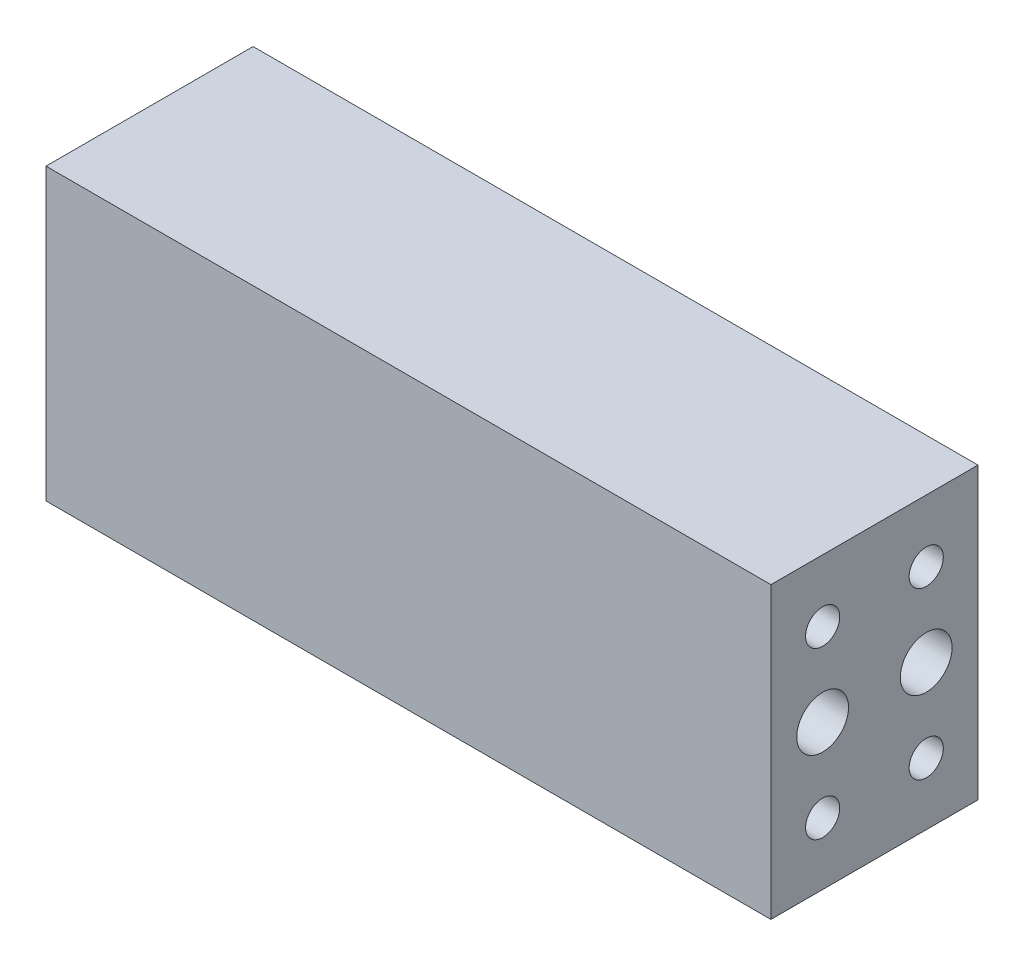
ISO-10303-21;
HEADER;
FILE_DESCRIPTION(('STEP AP214'),'2;1');
FILE_NAME('part.step','',(''),(''),'','','');
FILE_SCHEMA(('AUTOMOTIVE_DESIGN { 1 0 10303 214 1 1 1 1 }'));
ENDSEC;
DATA;
#1=APPLICATION_CONTEXT('core data for automotive mechanical design processes');
#2=APPLICATION_PROTOCOL_DEFINITION('international standard','automotive_design',2000,#1);
#3=PRODUCT_CONTEXT('',#1,'mechanical');
#4=PRODUCT('Part','Part','',(#3));
#5=PRODUCT_RELATED_PRODUCT_CATEGORY('part','',(#4));
#6=PRODUCT_DEFINITION_FORMATION('','',#4);
#7=PRODUCT_DEFINITION_CONTEXT('part definition',#1,'design');
#8=PRODUCT_DEFINITION('design','',#6,#7);
#9=PRODUCT_DEFINITION_SHAPE('','',#8);
#10=(LENGTH_UNIT() NAMED_UNIT(*) SI_UNIT(.MILLI.,.METRE.));
#11=(NAMED_UNIT(*) PLANE_ANGLE_UNIT() SI_UNIT($,.RADIAN.));
#12=(NAMED_UNIT(*) SI_UNIT($,.STERADIAN.) SOLID_ANGLE_UNIT());
#13=UNCERTAINTY_MEASURE_WITH_UNIT(LENGTH_MEASURE(1.E-05),#10,'distance_accuracy_value','');
#14=(GEOMETRIC_REPRESENTATION_CONTEXT(3) GLOBAL_UNCERTAINTY_ASSIGNED_CONTEXT((#13)) GLOBAL_UNIT_ASSIGNED_CONTEXT((#10,
#11,#12)) REPRESENTATION_CONTEXT('',''));
#15=CARTESIAN_POINT('',(0.,0.,0.));
#16=DIRECTION('',(0.,0.,1.));
#17=DIRECTION('',(1.,0.,0.));
#18=AXIS2_PLACEMENT_3D('',#15,#16,#17);
#19=CARTESIAN_POINT('',(0.,104.9879725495,20.));
#20=DIRECTION('',(-1.,0.,0.));
#21=DIRECTION('',(0.,0.,1.));
#22=AXIS2_PLACEMENT_3D('',#19,#20,#21);
#23=PLANE('',#22);
#24=CARTESIAN_POINT('',(0.,118.9879725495,5.));
#25=DIRECTION('',(1.,0.,0.));
#26=DIRECTION('',(0.,0.,-1.));
#27=AXIS2_PLACEMENT_3D('',#24,#25,#26);
#28=CIRCLE('',#27,2.5);
#29=CARTESIAN_POINT('',(0.,118.9879725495,2.5));
#30=VERTEX_POINT('',#29);
#31=EDGE_CURVE('E93',#30,#30,#28,.T.);
#32=ORIENTED_EDGE('',*,*,#31,.F.);
#33=EDGE_LOOP('',(#32));
#34=FACE_BOUND('',#33,.T.);
#35=CARTESIAN_POINT('',(0.,118.9879725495,15.));
#36=DIRECTION('',(1.,0.,0.));
#37=DIRECTION('',(0.,0.,-1.));
#38=AXIS2_PLACEMENT_3D('',#35,#36,#37);
#39=CIRCLE('',#38,2.5);
#40=CARTESIAN_POINT('',(0.,118.9879725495,12.5));
#41=VERTEX_POINT('',#40);
#42=EDGE_CURVE('E92',#41,#41,#39,.T.);
#43=ORIENTED_EDGE('',*,*,#42,.F.);
#44=EDGE_LOOP('',(#43));
#45=FACE_BOUND('',#44,.T.);
#46=CARTESIAN_POINT('',(0.,110.9879725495,5.));
#47=DIRECTION('',(1.,0.,0.));
#48=DIRECTION('',(0.,0.,-1.));
#49=AXIS2_PLACEMENT_3D('',#46,#47,#48);
#50=CIRCLE('',#49,1.65);
#51=CARTESIAN_POINT('',(0.,110.9879725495,3.35));
#52=VERTEX_POINT('',#51);
#53=EDGE_CURVE('E103',#52,#52,#50,.T.);
#54=ORIENTED_EDGE('',*,*,#53,.F.);
#55=EDGE_LOOP('',(#54));
#56=FACE_BOUND('',#55,.T.);
#57=CARTESIAN_POINT('',(0.,110.9879725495,15.));
#58=DIRECTION('',(1.,0.,0.));
#59=DIRECTION('',(0.,0.,-1.));
#60=AXIS2_PLACEMENT_3D('',#57,#58,#59);
#61=CIRCLE('',#60,1.65);
#62=CARTESIAN_POINT('',(0.,110.9879725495,13.35));
#63=VERTEX_POINT('',#62);
#64=EDGE_CURVE('E109',#63,#63,#61,.T.);
#65=ORIENTED_EDGE('',*,*,#64,.F.);
#66=EDGE_LOOP('',(#65));
#67=FACE_BOUND('',#66,.T.);
#68=CARTESIAN_POINT('',(0.,126.9879725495,5.));
#69=DIRECTION('',(1.,0.,0.));
#70=DIRECTION('',(0.,0.,-1.));
#71=AXIS2_PLACEMENT_3D('',#68,#69,#70);
#72=CIRCLE('',#71,1.65);
#73=CARTESIAN_POINT('',(0.,126.9879725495,3.35));
#74=VERTEX_POINT('',#73);
#75=EDGE_CURVE('E115',#74,#74,#72,.T.);
#76=ORIENTED_EDGE('',*,*,#75,.F.);
#77=EDGE_LOOP('',(#76));
#78=FACE_BOUND('',#77,.T.);
#79=CARTESIAN_POINT('',(0.,126.9879725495,15.));
#80=DIRECTION('',(1.,0.,0.));
#81=DIRECTION('',(0.,0.,-1.));
#82=AXIS2_PLACEMENT_3D('',#79,#80,#81);
#83=CIRCLE('',#82,1.65);
#84=CARTESIAN_POINT('',(0.,126.9879725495,13.35));
#85=VERTEX_POINT('',#84);
#86=EDGE_CURVE('E121',#85,#85,#83,.T.);
#87=ORIENTED_EDGE('',*,*,#86,.F.);
#88=EDGE_LOOP('',(#87));
#89=FACE_BOUND('',#88,.T.);
#90=DIRECTION('',(0.,1.,0.));
#91=VECTOR('',#90,1.);
#92=CARTESIAN_POINT('',(0.,104.9879725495,0.));
#93=LINE('',#92,#91);
#94=CARTESIAN_POINT('',(0.,104.9879725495,0.));
#95=VERTEX_POINT('',#94);
#96=CARTESIAN_POINT('',(0.,132.9879725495,0.));
#97=VERTEX_POINT('',#96);
#98=EDGE_CURVE('E127',#95,#97,#93,.T.);
#99=ORIENTED_EDGE('',*,*,#98,.T.);
#100=DIRECTION('',(0.,0.,-1.));
#101=VECTOR('',#100,1.);
#102=CARTESIAN_POINT('',(0.,132.9879725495,20.));
#103=LINE('',#102,#101);
#104=CARTESIAN_POINT('',(0.,132.9879725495,20.));
#105=VERTEX_POINT('',#104);
#106=EDGE_CURVE('E11',#105,#97,#103,.T.);
#107=ORIENTED_EDGE('',*,*,#106,.F.);
#108=DIRECTION('',(0.,1.,0.));
#109=VECTOR('',#108,1.);
#110=CARTESIAN_POINT('',(0.,104.9879725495,20.));
#111=LINE('',#110,#109);
#112=CARTESIAN_POINT('',(0.,104.9879725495,20.));
#113=VERTEX_POINT('',#112);
#114=EDGE_CURVE('E128',#113,#105,#111,.T.);
#115=ORIENTED_EDGE('',*,*,#114,.F.);
#116=DIRECTION('',(0.,0.,-1.));
#117=VECTOR('',#116,1.);
#118=CARTESIAN_POINT('',(0.,104.9879725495,20.));
#119=LINE('',#118,#117);
#120=EDGE_CURVE('E134',#113,#95,#119,.T.);
#121=ORIENTED_EDGE('',*,*,#120,.T.);
#122=EDGE_LOOP('',(#99,#107,#115,#121));
#123=FACE_BOUND('',#122,.T.);
#124=ADVANCED_FACE('F16',(#34,#45,#56,#67,#78,#89,#123),#23,.F.);
#125=CARTESIAN_POINT('',(0.,132.9879725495,20.));
#126=DIRECTION('',(0.,-1.,0.));
#127=DIRECTION('',(0.,0.,-1.));
#128=AXIS2_PLACEMENT_3D('',#125,#126,#127);
#129=PLANE('',#128);
#130=DIRECTION('',(-1.,0.,0.));
#131=VECTOR('',#130,1.);
#132=CARTESIAN_POINT('',(0.,132.9879725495,0.));
#133=LINE('',#132,#131);
#134=CARTESIAN_POINT('',(-70.,132.9879725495,0.));
#135=VERTEX_POINT('',#134);
#136=EDGE_CURVE('E137',#97,#135,#133,.T.);
#137=ORIENTED_EDGE('',*,*,#136,.T.);
#138=DIRECTION('',(0.,0.,-1.));
#139=VECTOR('',#138,1.);
#140=CARTESIAN_POINT('',(-70.,132.9879725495,20.));
#141=LINE('',#140,#139);
#142=CARTESIAN_POINT('',(-70.,132.9879725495,20.));
#143=VERTEX_POINT('',#142);
#144=EDGE_CURVE('E24',#143,#135,#141,.T.);
#145=ORIENTED_EDGE('',*,*,#144,.F.);
#146=DIRECTION('',(-1.,0.,0.));
#147=VECTOR('',#146,1.);
#148=CARTESIAN_POINT('',(0.,132.9879725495,20.));
#149=LINE('',#148,#147);
#150=EDGE_CURVE('E63',#105,#143,#149,.T.);
#151=ORIENTED_EDGE('',*,*,#150,.F.);
#152=ORIENTED_EDGE('',*,*,#106,.T.);
#153=EDGE_LOOP('',(#137,#145,#151,#152));
#154=FACE_BOUND('',#153,.T.);
#155=ADVANCED_FACE('F162',(#154),#129,.F.);
#156=CARTESIAN_POINT('',(-70.,104.9879725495,20.));
#157=DIRECTION('',(1.,0.,0.));
#158=DIRECTION('',(0.,0.,-1.));
#159=AXIS2_PLACEMENT_3D('',#156,#157,#158);
#160=PLANE('',#159);
#161=DIRECTION('',(0.,-1.,0.));
#162=VECTOR('',#161,1.);
#163=CARTESIAN_POINT('',(-70.,104.9879725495,0.));
#164=LINE('',#163,#162);
#165=CARTESIAN_POINT('',(-70.,104.9879725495,0.));
#166=VERTEX_POINT('',#165);
#167=EDGE_CURVE('E50',#135,#166,#164,.T.);
#168=ORIENTED_EDGE('',*,*,#167,.T.);
#169=DIRECTION('',(0.,0.,-1.));
#170=VECTOR('',#169,1.);
#171=CARTESIAN_POINT('',(-70.,104.9879725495,20.));
#172=LINE('',#171,#170);
#173=CARTESIAN_POINT('',(-70.,104.9879725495,20.));
#174=VERTEX_POINT('',#173);
#175=EDGE_CURVE('E142',#174,#166,#172,.T.);
#176=ORIENTED_EDGE('',*,*,#175,.F.);
#177=DIRECTION('',(0.,-1.,0.));
#178=VECTOR('',#177,1.);
#179=CARTESIAN_POINT('',(-70.,104.9879725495,20.));
#180=LINE('',#179,#178);
#181=EDGE_CURVE('E131',#143,#174,#180,.T.);
#182=ORIENTED_EDGE('',*,*,#181,.F.);
#183=ORIENTED_EDGE('',*,*,#144,.T.);
#184=EDGE_LOOP('',(#168,#176,#182,#183));
#185=FACE_BOUND('',#184,.T.);
#186=ADVANCED_FACE('F144',(#185),#160,.F.);
#187=CARTESIAN_POINT('',(0.,104.9879725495,20.));
#188=DIRECTION('',(0.,1.,0.));
#189=DIRECTION('',(-1.,0.,0.));
#190=AXIS2_PLACEMENT_3D('',#187,#188,#189);
#191=PLANE('',#190);
#192=DIRECTION('',(1.,0.,0.));
#193=VECTOR('',#192,1.);
#194=CARTESIAN_POINT('',(0.,104.9879725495,0.));
#195=LINE('',#194,#193);
#196=EDGE_CURVE('E56',#166,#95,#195,.T.);
#197=ORIENTED_EDGE('',*,*,#196,.T.);
#198=ORIENTED_EDGE('',*,*,#120,.F.);
#199=DIRECTION('',(1.,0.,0.));
#200=VECTOR('',#199,1.);
#201=CARTESIAN_POINT('',(0.,104.9879725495,20.));
#202=LINE('',#201,#200);
#203=EDGE_CURVE('E32',#174,#113,#202,.T.);
#204=ORIENTED_EDGE('',*,*,#203,.F.);
#205=ORIENTED_EDGE('',*,*,#175,.T.);
#206=EDGE_LOOP('',(#197,#198,#204,#205));
#207=FACE_BOUND('',#206,.T.);
#208=ADVANCED_FACE('F151',(#207),#191,.F.);
#209=CARTESIAN_POINT('',(0.,0.,20.));
#210=DIRECTION('',(0.,0.,1.));
#211=DIRECTION('',(1.,0.,0.));
#212=AXIS2_PLACEMENT_3D('',#209,#210,#211);
#213=PLANE('',#212);
#214=ORIENTED_EDGE('',*,*,#114,.T.);
#215=ORIENTED_EDGE('',*,*,#150,.T.);
#216=ORIENTED_EDGE('',*,*,#181,.T.);
#217=ORIENTED_EDGE('',*,*,#203,.T.);
#218=EDGE_LOOP('',(#214,#215,#216,#217));
#219=FACE_BOUND('',#218,.T.);
#220=ADVANCED_FACE('F153',(#219),#213,.T.);
#221=CARTESIAN_POINT('',(0.,0.,0.));
#222=DIRECTION('',(0.,0.,1.));
#223=DIRECTION('',(1.,0.,0.));
#224=AXIS2_PLACEMENT_3D('',#221,#222,#223);
#225=PLANE('',#224);
#226=ORIENTED_EDGE('',*,*,#98,.F.);
#227=ORIENTED_EDGE('',*,*,#196,.F.);
#228=ORIENTED_EDGE('',*,*,#167,.F.);
#229=ORIENTED_EDGE('',*,*,#136,.F.);
#230=EDGE_LOOP('',(#226,#227,#228,#229));
#231=FACE_BOUND('',#230,.T.);
#232=ADVANCED_FACE('F147',(#231),#225,.F.);
#233=CARTESIAN_POINT('',(-14.1,126.9879725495,15.));
#234=DIRECTION('',(1.,0.,0.));
#235=DIRECTION('',(0.,0.,-1.));
#236=AXIS2_PLACEMENT_3D('',#233,#234,#235);
#237=CONICAL_SURFACE('',#236,1.65,1.02974425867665);
#238=CARTESIAN_POINT('',(-15.0914200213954,126.9879725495,15.));
#239=VERTEX_POINT('',#238);
#240=VERTEX_LOOP('',#239);
#241=FACE_BOUND('',#240,.T.);
#242=CARTESIAN_POINT('',(-14.1,126.9879725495,15.));
#243=DIRECTION('',(1.,0.,0.));
#244=DIRECTION('',(0.,0.,-1.));
#245=AXIS2_PLACEMENT_3D('',#242,#243,#244);
#246=CIRCLE('',#245,1.65);
#247=CARTESIAN_POINT('',(-14.1,126.9879725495,13.35));
#248=VERTEX_POINT('',#247);
#249=EDGE_CURVE('E124',#248,#248,#246,.T.);
#250=ORIENTED_EDGE('',*,*,#249,.T.);
#251=EDGE_LOOP('',(#250));
#252=FACE_BOUND('',#251,.T.);
#253=ADVANCED_FACE('F186',(#241,#252),#237,.F.);
#254=CARTESIAN_POINT('',(0.,126.9879725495,15.));
#255=DIRECTION('',(1.,0.,0.));
#256=DIRECTION('',(0.,0.,-1.));
#257=AXIS2_PLACEMENT_3D('',#254,#255,#256);
#258=CYLINDRICAL_SURFACE('',#257,1.65);
#259=ORIENTED_EDGE('',*,*,#249,.F.);
#260=EDGE_LOOP('',(#259));
#261=FACE_BOUND('',#260,.T.);
#262=ORIENTED_EDGE('',*,*,#86,.T.);
#263=EDGE_LOOP('',(#262));
#264=FACE_BOUND('',#263,.T.);
#265=ADVANCED_FACE('F183',(#261,#264),#258,.F.);
#266=CARTESIAN_POINT('',(-14.1,126.9879725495,5.));
#267=DIRECTION('',(1.,0.,0.));
#268=DIRECTION('',(0.,0.,-1.));
#269=AXIS2_PLACEMENT_3D('',#266,#267,#268);
#270=CONICAL_SURFACE('',#269,1.65,1.02974425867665);
#271=CARTESIAN_POINT('',(-15.0914200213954,126.9879725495,5.));
#272=VERTEX_POINT('',#271);
#273=VERTEX_LOOP('',#272);
#274=FACE_BOUND('',#273,.T.);
#275=CARTESIAN_POINT('',(-14.1,126.9879725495,5.));
#276=DIRECTION('',(1.,0.,0.));
#277=DIRECTION('',(0.,0.,-1.));
#278=AXIS2_PLACEMENT_3D('',#275,#276,#277);
#279=CIRCLE('',#278,1.65);
#280=CARTESIAN_POINT('',(-14.1,126.9879725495,3.35));
#281=VERTEX_POINT('',#280);
#282=EDGE_CURVE('E118',#281,#281,#279,.T.);
#283=ORIENTED_EDGE('',*,*,#282,.T.);
#284=EDGE_LOOP('',(#283));
#285=FACE_BOUND('',#284,.T.);
#286=ADVANCED_FACE('F185',(#274,#285),#270,.F.);
#287=CARTESIAN_POINT('',(0.,126.9879725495,5.));
#288=DIRECTION('',(1.,0.,0.));
#289=DIRECTION('',(0.,0.,-1.));
#290=AXIS2_PLACEMENT_3D('',#287,#288,#289);
#291=CYLINDRICAL_SURFACE('',#290,1.65);
#292=ORIENTED_EDGE('',*,*,#282,.F.);
#293=EDGE_LOOP('',(#292));
#294=FACE_BOUND('',#293,.T.);
#295=ORIENTED_EDGE('',*,*,#75,.T.);
#296=EDGE_LOOP('',(#295));
#297=FACE_BOUND('',#296,.T.);
#298=ADVANCED_FACE('F194',(#294,#297),#291,.F.);
#299=CARTESIAN_POINT('',(-14.1,110.9879725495,15.));
#300=DIRECTION('',(1.,0.,0.));
#301=DIRECTION('',(0.,0.,-1.));
#302=AXIS2_PLACEMENT_3D('',#299,#300,#301);
#303=CONICAL_SURFACE('',#302,1.65,1.02974425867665);
#304=CARTESIAN_POINT('',(-15.0914200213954,110.9879725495,15.));
#305=VERTEX_POINT('',#304);
#306=VERTEX_LOOP('',#305);
#307=FACE_BOUND('',#306,.T.);
#308=CARTESIAN_POINT('',(-14.1,110.9879725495,15.));
#309=DIRECTION('',(1.,0.,0.));
#310=DIRECTION('',(0.,0.,-1.));
#311=AXIS2_PLACEMENT_3D('',#308,#309,#310);
#312=CIRCLE('',#311,1.65);
#313=CARTESIAN_POINT('',(-14.1,110.9879725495,13.35));
#314=VERTEX_POINT('',#313);
#315=EDGE_CURVE('E112',#314,#314,#312,.T.);
#316=ORIENTED_EDGE('',*,*,#315,.T.);
#317=EDGE_LOOP('',(#316));
#318=FACE_BOUND('',#317,.T.);
#319=ADVANCED_FACE('F236',(#307,#318),#303,.F.);
#320=CARTESIAN_POINT('',(0.,110.9879725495,15.));
#321=DIRECTION('',(1.,0.,0.));
#322=DIRECTION('',(0.,0.,-1.));
#323=AXIS2_PLACEMENT_3D('',#320,#321,#322);
#324=CYLINDRICAL_SURFACE('',#323,1.65);
#325=ORIENTED_EDGE('',*,*,#315,.F.);
#326=EDGE_LOOP('',(#325));
#327=FACE_BOUND('',#326,.T.);
#328=ORIENTED_EDGE('',*,*,#64,.T.);
#329=EDGE_LOOP('',(#328));
#330=FACE_BOUND('',#329,.T.);
#331=ADVANCED_FACE('F245',(#327,#330),#324,.F.);
#332=CARTESIAN_POINT('',(-14.1,110.9879725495,5.));
#333=DIRECTION('',(1.,0.,0.));
#334=DIRECTION('',(0.,0.,-1.));
#335=AXIS2_PLACEMENT_3D('',#332,#333,#334);
#336=CONICAL_SURFACE('',#335,1.65,1.02974425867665);
#337=CARTESIAN_POINT('',(-15.0914200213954,110.9879725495,5.));
#338=VERTEX_POINT('',#337);
#339=VERTEX_LOOP('',#338);
#340=FACE_BOUND('',#339,.T.);
#341=CARTESIAN_POINT('',(-14.1,110.9879725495,5.));
#342=DIRECTION('',(1.,0.,0.));
#343=DIRECTION('',(0.,0.,-1.));
#344=AXIS2_PLACEMENT_3D('',#341,#342,#343);
#345=CIRCLE('',#344,1.65);
#346=CARTESIAN_POINT('',(-14.1,110.9879725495,3.35));
#347=VERTEX_POINT('',#346);
#348=EDGE_CURVE('E106',#347,#347,#345,.T.);
#349=ORIENTED_EDGE('',*,*,#348,.T.);
#350=EDGE_LOOP('',(#349));
#351=FACE_BOUND('',#350,.T.);
#352=ADVANCED_FACE('F255',(#340,#351),#336,.F.);
#353=CARTESIAN_POINT('',(0.,110.9879725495,5.));
#354=DIRECTION('',(1.,0.,0.));
#355=DIRECTION('',(0.,0.,-1.));
#356=AXIS2_PLACEMENT_3D('',#353,#354,#355);
#357=CYLINDRICAL_SURFACE('',#356,1.65);
#358=ORIENTED_EDGE('',*,*,#348,.F.);
#359=EDGE_LOOP('',(#358));
#360=FACE_BOUND('',#359,.T.);
#361=ORIENTED_EDGE('',*,*,#53,.T.);
#362=EDGE_LOOP('',(#361));
#363=FACE_BOUND('',#362,.T.);
#364=ADVANCED_FACE('F265',(#360,#363),#357,.F.);
#365=CARTESIAN_POINT('',(-12.,118.9879725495,15.));
#366=DIRECTION('',(1.,0.,0.));
#367=DIRECTION('',(0.,0.,-1.));
#368=AXIS2_PLACEMENT_3D('',#365,#366,#367);
#369=CONICAL_SURFACE('',#368,2.5,1.02974425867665);
#370=CARTESIAN_POINT('',(-13.5021515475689,118.9879725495,15.));
#371=VERTEX_POINT('',#370);
#372=VERTEX_LOOP('',#371);
#373=FACE_BOUND('',#372,.T.);
#374=CARTESIAN_POINT('',(-12.,118.9879725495,15.));
#375=DIRECTION('',(1.,0.,0.));
#376=DIRECTION('',(0.,0.,-1.));
#377=AXIS2_PLACEMENT_3D('',#374,#375,#376);
#378=CIRCLE('',#377,2.5);
#379=CARTESIAN_POINT('',(-12.,118.9879725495,12.5));
#380=VERTEX_POINT('',#379);
#381=EDGE_CURVE('E96',#380,#380,#378,.T.);
#382=ORIENTED_EDGE('',*,*,#381,.T.);
#383=EDGE_LOOP('',(#382));
#384=FACE_BOUND('',#383,.T.);
#385=ADVANCED_FACE('F275',(#373,#384),#369,.F.);
#386=CARTESIAN_POINT('',(0.,118.9879725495,15.));
#387=DIRECTION('',(1.,0.,0.));
#388=DIRECTION('',(0.,0.,-1.));
#389=AXIS2_PLACEMENT_3D('',#386,#387,#388);
#390=CYLINDRICAL_SURFACE('',#389,2.5);
#391=ORIENTED_EDGE('',*,*,#381,.F.);
#392=EDGE_LOOP('',(#391));
#393=FACE_BOUND('',#392,.T.);
#394=ORIENTED_EDGE('',*,*,#42,.T.);
#395=EDGE_LOOP('',(#394));
#396=FACE_BOUND('',#395,.T.);
#397=ADVANCED_FACE('F86',(#393,#396),#390,.F.);
#398=CARTESIAN_POINT('',(-12.,118.9879725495,5.));
#399=DIRECTION('',(1.,0.,0.));
#400=DIRECTION('',(0.,0.,-1.));
#401=AXIS2_PLACEMENT_3D('',#398,#399,#400);
#402=CONICAL_SURFACE('',#401,2.5,1.02974425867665);
#403=CARTESIAN_POINT('',(-13.5021515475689,118.9879725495,5.));
#404=VERTEX_POINT('',#403);
#405=VERTEX_LOOP('',#404);
#406=FACE_BOUND('',#405,.T.);
#407=CARTESIAN_POINT('',(-12.,118.9879725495,5.));
#408=DIRECTION('',(1.,0.,0.));
#409=DIRECTION('',(0.,0.,-1.));
#410=AXIS2_PLACEMENT_3D('',#407,#408,#409);
#411=CIRCLE('',#410,2.5);
#412=CARTESIAN_POINT('',(-12.,118.9879725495,2.5));
#413=VERTEX_POINT('',#412);
#414=EDGE_CURVE('E90',#413,#413,#411,.T.);
#415=ORIENTED_EDGE('',*,*,#414,.T.);
#416=EDGE_LOOP('',(#415));
#417=FACE_BOUND('',#416,.T.);
#418=ADVANCED_FACE('F82',(#406,#417),#402,.F.);
#419=CARTESIAN_POINT('',(0.,118.9879725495,5.));
#420=DIRECTION('',(1.,0.,0.));
#421=DIRECTION('',(0.,0.,-1.));
#422=AXIS2_PLACEMENT_3D('',#419,#420,#421);
#423=CYLINDRICAL_SURFACE('',#422,2.5);
#424=ORIENTED_EDGE('',*,*,#414,.F.);
#425=EDGE_LOOP('',(#424));
#426=FACE_BOUND('',#425,.T.);
#427=ORIENTED_EDGE('',*,*,#31,.T.);
#428=EDGE_LOOP('',(#427));
#429=FACE_BOUND('',#428,.T.);
#430=ADVANCED_FACE('F85',(#426,#429),#423,.F.);
#431=CLOSED_SHELL('',(#124,#155,#186,#208,#220,#232,#253,#265,#286,#298,#319,#331,#352,#364,
#385,#397,#418,#430));
#432=MANIFOLD_SOLID_BREP('B1',#431);
#433=ADVANCED_BREP_SHAPE_REPRESENTATION('',(#18,#432),#14);
#434=SHAPE_DEFINITION_REPRESENTATION(#9,#433);
ENDSEC;
END-ISO-10303-21;
